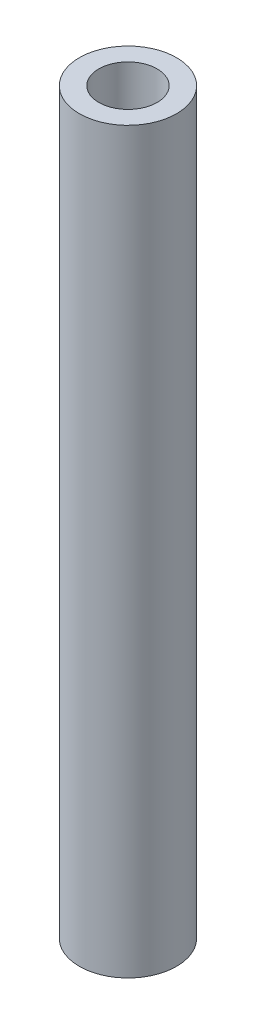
from build123d import *

# Parameters (mm, degrees)
SKETCH_1_R      = 2.5
SKETCH_1_R_2    = 1.5
EXTRUDE_1_DEPTH = 19


with BuildPart() as part:
    # Sketch 1 → Extrude 1 (new, symmetric)
    with BuildSketch(Plane(origin=(0, 0, 0), x_dir=(1, 0, 0), z_dir=(0, 1, 0))):
        with Locations(Location((0, 0, 0), (0, 0, 270))):
            Circle(SKETCH_1_R)
        with Locations(Location((0, 0, 0), (0, 0, 270))):
            Circle(SKETCH_1_R_2, mode=Mode.SUBTRACT)
    extrude(amount=EXTRUDE_1_DEPTH, both=True)


solid = part.part
